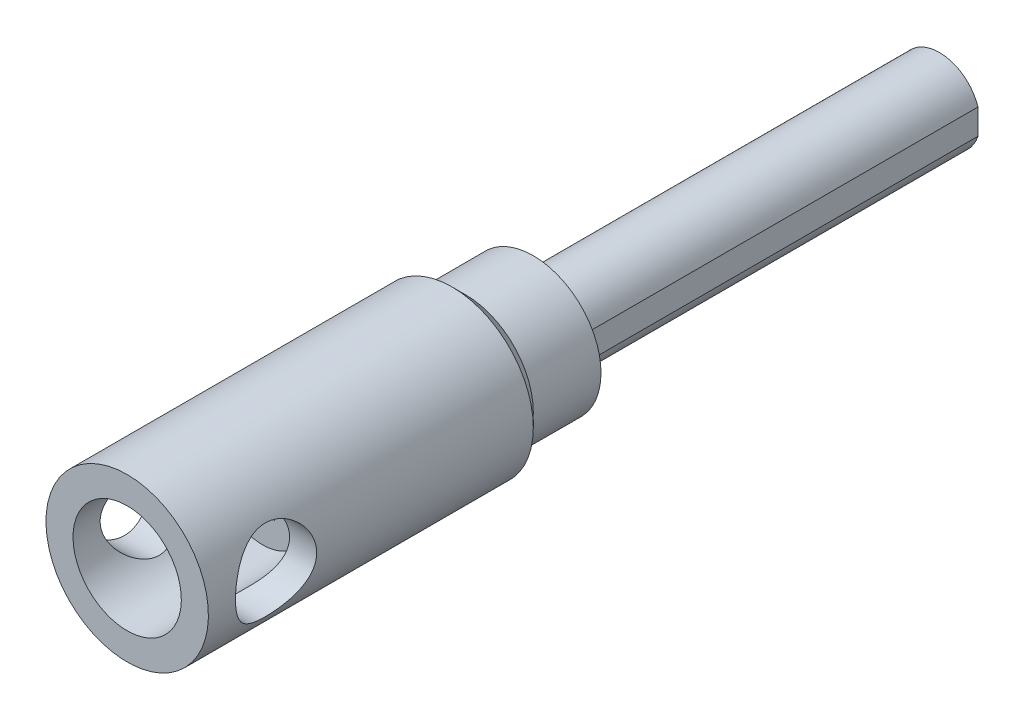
ISO-10303-21;
HEADER;
FILE_DESCRIPTION(('STEP AP214'),'2;1');
FILE_NAME('part.step','',(''),(''),'','','');
FILE_SCHEMA(('AUTOMOTIVE_DESIGN { 1 0 10303 214 1 1 1 1 }'));
ENDSEC;
DATA;
#1=APPLICATION_CONTEXT('core data for automotive mechanical design processes');
#2=APPLICATION_PROTOCOL_DEFINITION('international standard','automotive_design',2000,#1);
#3=PRODUCT_CONTEXT('',#1,'mechanical');
#4=PRODUCT('Part','Part','',(#3));
#5=PRODUCT_RELATED_PRODUCT_CATEGORY('part','',(#4));
#6=PRODUCT_DEFINITION_FORMATION('','',#4);
#7=PRODUCT_DEFINITION_CONTEXT('part definition',#1,'design');
#8=PRODUCT_DEFINITION('design','',#6,#7);
#9=PRODUCT_DEFINITION_SHAPE('','',#8);
#10=(LENGTH_UNIT() NAMED_UNIT(*) SI_UNIT(.MILLI.,.METRE.));
#11=(NAMED_UNIT(*) PLANE_ANGLE_UNIT() SI_UNIT($,.RADIAN.));
#12=(NAMED_UNIT(*) SI_UNIT($,.STERADIAN.) SOLID_ANGLE_UNIT());
#13=UNCERTAINTY_MEASURE_WITH_UNIT(LENGTH_MEASURE(1.E-05),#10,'distance_accuracy_value','');
#14=(GEOMETRIC_REPRESENTATION_CONTEXT(3) GLOBAL_UNCERTAINTY_ASSIGNED_CONTEXT((#13)) GLOBAL_UNIT_ASSIGNED_CONTEXT((#10,
#11,#12)) REPRESENTATION_CONTEXT('',''));
#15=CARTESIAN_POINT('',(0.,0.,0.));
#16=DIRECTION('',(0.,0.,1.));
#17=DIRECTION('',(1.,0.,0.));
#18=AXIS2_PLACEMENT_3D('',#15,#16,#17);
#19=CARTESIAN_POINT('',(-1.73205080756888,8.40265377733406E-13,48.));
#20=DIRECTION('',(0.866025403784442,-0.5,0.));
#21=DIRECTION('',(0.5,0.866025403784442,0.));
#22=AXIS2_PLACEMENT_3D('',#19,#20,#21);
#23=PLANE('',#22);
#24=DIRECTION('',(0.,0.,1.));
#25=VECTOR('',#24,1.);
#26=CARTESIAN_POINT('',(-0.866025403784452,1.50000000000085,48.));
#27=LINE('',#26,#25);
#28=CARTESIAN_POINT('',(-0.866025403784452,1.50000000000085,48.));
#29=VERTEX_POINT('',#28);
#30=CARTESIAN_POINT('',(-0.866025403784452,1.50000000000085,50.));
#31=VERTEX_POINT('',#30);
#32=EDGE_CURVE('E257',#29,#31,#27,.T.);
#33=ORIENTED_EDGE('',*,*,#32,.T.);
#34=DIRECTION('',(0.5,0.866025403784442,0.));
#35=VECTOR('',#34,1.);
#36=CARTESIAN_POINT('',(-1.73205080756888,8.40496674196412E-13,50.));
#37=LINE('',#36,#35);
#38=CARTESIAN_POINT('',(-1.73205080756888,8.40605094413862E-13,50.));
#39=VERTEX_POINT('',#38);
#40=EDGE_CURVE('E29',#39,#31,#37,.T.);
#41=ORIENTED_EDGE('',*,*,#40,.F.);
#42=DIRECTION('',(0.,0.,1.));
#43=VECTOR('',#42,1.);
#44=CARTESIAN_POINT('',(-1.73205080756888,8.40265377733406E-13,48.));
#45=LINE('',#44,#43);
#46=CARTESIAN_POINT('',(-1.73205080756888,8.40265377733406E-13,48.));
#47=VERTEX_POINT('',#46);
#48=EDGE_CURVE('E33',#47,#39,#45,.T.);
#49=ORIENTED_EDGE('',*,*,#48,.F.);
#50=DIRECTION('',(0.5,0.866025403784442,0.));
#51=VECTOR('',#50,1.);
#52=CARTESIAN_POINT('',(-1.73205080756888,8.40265377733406E-13,48.));
#53=LINE('',#52,#51);
#54=EDGE_CURVE('E218',#47,#29,#53,.T.);
#55=ORIENTED_EDGE('',*,*,#54,.T.);
#56=EDGE_LOOP('',(#33,#41,#49,#55));
#57=FACE_BOUND('',#56,.T.);
#58=ADVANCED_FACE('F14',(#57),#23,.T.);
#59=CARTESIAN_POINT('',(0.86602540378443,1.50000000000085,48.));
#60=DIRECTION('',(0.,1.,0.));
#61=DIRECTION('',(-1.,0.,0.));
#62=AXIS2_PLACEMENT_3D('',#59,#60,#61);
#63=PLANE('',#62);
#64=DIRECTION('',(0.,0.,1.));
#65=VECTOR('',#64,1.);
#66=CARTESIAN_POINT('',(0.86602540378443,1.50000000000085,48.));
#67=LINE('',#66,#65);
#68=CARTESIAN_POINT('',(0.86602540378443,1.50000000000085,48.));
#69=VERTEX_POINT('',#68);
#70=CARTESIAN_POINT('',(0.86602540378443,1.50000000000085,50.));
#71=VERTEX_POINT('',#70);
#72=EDGE_CURVE('E255',#69,#71,#67,.T.);
#73=ORIENTED_EDGE('',*,*,#72,.T.);
#74=DIRECTION('',(-1.,0.,0.));
#75=VECTOR('',#74,1.);
#76=CARTESIAN_POINT('',(0.86602540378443,1.50000000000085,50.));
#77=LINE('',#76,#75);
#78=EDGE_CURVE('E230',#71,#31,#77,.T.);
#79=ORIENTED_EDGE('',*,*,#78,.T.);
#80=ORIENTED_EDGE('',*,*,#32,.F.);
#81=DIRECTION('',(-1.,0.,0.));
#82=VECTOR('',#81,1.);
#83=CARTESIAN_POINT('',(0.86602540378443,1.50000000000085,48.));
#84=LINE('',#83,#82);
#85=EDGE_CURVE('E220',#69,#29,#84,.T.);
#86=ORIENTED_EDGE('',*,*,#85,.F.);
#87=EDGE_LOOP('',(#73,#79,#80,#86));
#88=FACE_BOUND('',#87,.T.);
#89=ADVANCED_FACE('F172',(#88),#63,.F.);
#90=CARTESIAN_POINT('',(1.73205080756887,8.54675106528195E-13,48.));
#91=DIRECTION('',(0.866025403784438,0.5,0.));
#92=DIRECTION('',(-0.5,0.866025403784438,0.));
#93=AXIS2_PLACEMENT_3D('',#90,#91,#92);
#94=PLANE('',#93);
#95=DIRECTION('',(0.,0.,1.));
#96=VECTOR('',#95,1.);
#97=CARTESIAN_POINT('',(1.73205080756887,8.54675106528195E-13,48.));
#98=LINE('',#97,#96);
#99=CARTESIAN_POINT('',(1.73205080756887,8.54675106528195E-13,48.));
#100=VERTEX_POINT('',#99);
#101=CARTESIAN_POINT('',(1.73205080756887,8.54906402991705E-13,50.));
#102=VERTEX_POINT('',#101);
#103=EDGE_CURVE('E253',#100,#102,#98,.T.);
#104=ORIENTED_EDGE('',*,*,#103,.T.);
#105=DIRECTION('',(-0.5,0.866025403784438,0.));
#106=VECTOR('',#105,1.);
#107=CARTESIAN_POINT('',(1.73205080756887,8.54906402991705E-13,50.));
#108=LINE('',#107,#106);
#109=EDGE_CURVE('E227',#102,#71,#108,.T.);
#110=ORIENTED_EDGE('',*,*,#109,.T.);
#111=ORIENTED_EDGE('',*,*,#72,.F.);
#112=DIRECTION('',(-0.5,0.866025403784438,0.));
#113=VECTOR('',#112,1.);
#114=CARTESIAN_POINT('',(1.73205080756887,8.54675106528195E-13,48.));
#115=LINE('',#114,#113);
#116=EDGE_CURVE('E243',#100,#69,#115,.T.);
#117=ORIENTED_EDGE('',*,*,#116,.F.);
#118=EDGE_LOOP('',(#104,#110,#111,#117));
#119=FACE_BOUND('',#118,.T.);
#120=ADVANCED_FACE('F177',(#119),#94,.F.);
#121=CARTESIAN_POINT('',(1.73205080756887,8.54675106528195E-13,48.));
#122=DIRECTION('',(-0.866025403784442,0.5,0.));
#123=DIRECTION('',(-0.5,-0.866025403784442,0.));
#124=AXIS2_PLACEMENT_3D('',#121,#122,#123);
#125=PLANE('',#124);
#126=DIRECTION('',(0.,0.,1.));
#127=VECTOR('',#126,1.);
#128=CARTESIAN_POINT('',(0.866025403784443,-1.49999999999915,48.));
#129=LINE('',#128,#127);
#130=CARTESIAN_POINT('',(0.866025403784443,-1.49999999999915,48.));
#131=VERTEX_POINT('',#130);
#132=CARTESIAN_POINT('',(0.866025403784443,-1.49999999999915,50.));
#133=VERTEX_POINT('',#132);
#134=EDGE_CURVE('E251',#131,#133,#129,.T.);
#135=ORIENTED_EDGE('',*,*,#134,.T.);
#136=DIRECTION('',(-0.5,-0.866025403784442,0.));
#137=VECTOR('',#136,1.);
#138=CARTESIAN_POINT('',(1.73205080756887,8.54906402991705E-13,50.));
#139=LINE('',#138,#137);
#140=EDGE_CURVE('E222',#102,#133,#139,.T.);
#141=ORIENTED_EDGE('',*,*,#140,.F.);
#142=ORIENTED_EDGE('',*,*,#103,.F.);
#143=DIRECTION('',(-0.5,-0.866025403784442,0.));
#144=VECTOR('',#143,1.);
#145=CARTESIAN_POINT('',(1.73205080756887,8.54675106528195E-13,48.));
#146=LINE('',#145,#144);
#147=EDGE_CURVE('E240',#100,#131,#146,.T.);
#148=ORIENTED_EDGE('',*,*,#147,.T.);
#149=EDGE_LOOP('',(#135,#141,#142,#148));
#150=FACE_BOUND('',#149,.T.);
#151=ADVANCED_FACE('F189',(#150),#125,.T.);
#152=CARTESIAN_POINT('',(-0.866025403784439,-1.49999999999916,48.));
#153=DIRECTION('',(0.,-1.,0.));
#154=DIRECTION('',(1.,0.,0.));
#155=AXIS2_PLACEMENT_3D('',#152,#153,#154);
#156=PLANE('',#155);
#157=DIRECTION('',(0.,0.,1.));
#158=VECTOR('',#157,1.);
#159=CARTESIAN_POINT('',(-0.866025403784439,-1.49999999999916,48.));
#160=LINE('',#159,#158);
#161=CARTESIAN_POINT('',(-0.866025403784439,-1.49999999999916,48.));
#162=VERTEX_POINT('',#161);
#163=CARTESIAN_POINT('',(-0.866025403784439,-1.49999999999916,50.));
#164=VERTEX_POINT('',#163);
#165=EDGE_CURVE('E249',#162,#164,#160,.T.);
#166=ORIENTED_EDGE('',*,*,#165,.T.);
#167=DIRECTION('',(1.,0.,0.));
#168=VECTOR('',#167,1.);
#169=CARTESIAN_POINT('',(-0.866025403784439,-1.49999999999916,50.));
#170=LINE('',#169,#168);
#171=EDGE_CURVE('E217',#164,#133,#170,.T.);
#172=ORIENTED_EDGE('',*,*,#171,.T.);
#173=ORIENTED_EDGE('',*,*,#134,.F.);
#174=DIRECTION('',(1.,0.,0.));
#175=VECTOR('',#174,1.);
#176=CARTESIAN_POINT('',(-0.866025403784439,-1.49999999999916,48.));
#177=LINE('',#176,#175);
#178=EDGE_CURVE('E237',#162,#131,#177,.T.);
#179=ORIENTED_EDGE('',*,*,#178,.F.);
#180=EDGE_LOOP('',(#166,#172,#173,#179));
#181=FACE_BOUND('',#180,.T.);
#182=ADVANCED_FACE('F185',(#181),#156,.F.);
#183=CARTESIAN_POINT('',(-1.73205080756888,8.40265377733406E-13,48.));
#184=DIRECTION('',(-0.866025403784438,-0.5,0.));
#185=DIRECTION('',(0.5,-0.866025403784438,0.));
#186=AXIS2_PLACEMENT_3D('',#183,#184,#185);
#187=PLANE('',#186);
#188=DIRECTION('',(0.5,-0.866025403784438,0.));
#189=VECTOR('',#188,1.);
#190=CARTESIAN_POINT('',(-1.73205080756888,8.40265377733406E-13,48.));
#191=LINE('',#190,#189);
#192=EDGE_CURVE('E234',#47,#162,#191,.T.);
#193=ORIENTED_EDGE('',*,*,#192,.F.);
#194=ORIENTED_EDGE('',*,*,#48,.T.);
#195=DIRECTION('',(0.5,-0.866025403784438,0.));
#196=VECTOR('',#195,1.);
#197=CARTESIAN_POINT('',(-1.73205080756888,8.40496674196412E-13,50.));
#198=LINE('',#197,#196);
#199=EDGE_CURVE('E213',#39,#164,#198,.T.);
#200=ORIENTED_EDGE('',*,*,#199,.T.);
#201=ORIENTED_EDGE('',*,*,#165,.F.);
#202=EDGE_LOOP('',(#193,#194,#200,#201));
#203=FACE_BOUND('',#202,.T.);
#204=ADVANCED_FACE('F182',(#203),#187,.F.);
#205=CARTESIAN_POINT('',(-0.866025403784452,1.50000000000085,48.));
#206=DIRECTION('',(0.,0.,1.));
#207=DIRECTION('',(0.,1.,0.));
#208=AXIS2_PLACEMENT_3D('',#205,#206,#207);
#209=PLANE('',#208);
#210=ORIENTED_EDGE('',*,*,#54,.F.);
#211=ORIENTED_EDGE('',*,*,#192,.T.);
#212=ORIENTED_EDGE('',*,*,#178,.T.);
#213=ORIENTED_EDGE('',*,*,#147,.F.);
#214=ORIENTED_EDGE('',*,*,#116,.T.);
#215=ORIENTED_EDGE('',*,*,#85,.T.);
#216=EDGE_LOOP('',(#210,#211,#212,#213,#214,#215));
#217=FACE_BOUND('',#216,.T.);
#218=ADVANCED_FACE('F181',(#217),#209,.T.);
#219=CARTESIAN_POINT('',(0.,8.47701538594E-13,50.));
#220=DIRECTION('',(0.,0.,1.));
#221=DIRECTION('',(0.,1.,0.));
#222=AXIS2_PLACEMENT_3D('',#219,#220,#221);
#223=PLANE('',#222);
#224=CARTESIAN_POINT('',(0.,8.47701538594E-13,50.));
#225=DIRECTION('',(0.,0.,1.));
#226=DIRECTION('',(0.,1.,0.));
#227=AXIS2_PLACEMENT_3D('',#224,#225,#226);
#228=CIRCLE('',#227,3.5);
#229=CARTESIAN_POINT('',(0.,3.50000000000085,50.));
#230=VERTEX_POINT('',#229);
#231=EDGE_CURVE('E9',#230,#230,#228,.T.);
#232=ORIENTED_EDGE('',*,*,#231,.T.);
#233=EDGE_LOOP('',(#232));
#234=FACE_BOUND('',#233,.T.);
#235=ORIENTED_EDGE('',*,*,#199,.F.);
#236=ORIENTED_EDGE('',*,*,#40,.T.);
#237=ORIENTED_EDGE('',*,*,#78,.F.);
#238=ORIENTED_EDGE('',*,*,#109,.F.);
#239=ORIENTED_EDGE('',*,*,#140,.T.);
#240=ORIENTED_EDGE('',*,*,#171,.F.);
#241=EDGE_LOOP('',(#235,#236,#237,#238,#239,#240));
#242=FACE_BOUND('',#241,.T.);
#243=ADVANCED_FACE('F16',(#234,#242),#223,.T.);
#244=CARTESIAN_POINT('',(0.,8.48164131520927E-13,54.));
#245=DIRECTION('',(0.,0.,1.));
#246=DIRECTION('',(0.,1.,0.));
#247=AXIS2_PLACEMENT_3D('',#244,#245,#246);
#248=CYLINDRICAL_SURFACE('',#247,3.5);
#249=CARTESIAN_POINT('',(0.,8.47238945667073E-13,46.));
#250=DIRECTION('',(0.,0.,1.));
#251=DIRECTION('',(0.,1.,0.));
#252=AXIS2_PLACEMENT_3D('',#249,#250,#251);
#253=CIRCLE('',#252,3.5);
#254=CARTESIAN_POINT('',(0.,3.50000000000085,46.));
#255=VERTEX_POINT('',#254);
#256=EDGE_CURVE('E22',#255,#255,#253,.T.);
#257=ORIENTED_EDGE('',*,*,#256,.T.);
#258=EDGE_LOOP('',(#257));
#259=FACE_BOUND('',#258,.T.);
#260=ORIENTED_EDGE('',*,*,#231,.F.);
#261=EDGE_LOOP('',(#260));
#262=FACE_BOUND('',#261,.T.);
#263=ADVANCED_FACE('F196',(#259,#262),#248,.T.);
#264=CARTESIAN_POINT('',(3.,0.,0.));
#265=DIRECTION('',(0.,0.,-1.));
#266=DIRECTION('',(1.,0.,0.));
#267=AXIS2_PLACEMENT_3D('',#264,#265,#266);
#268=PLANE('',#267);
#269=DIRECTION('',(0.,-1.,0.));
#270=VECTOR('',#269,1.);
#271=CARTESIAN_POINT('',(2.85,-0.93674969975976,0.));
#272=LINE('',#271,#270);
#273=CARTESIAN_POINT('',(2.85,0.936749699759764,0.));
#274=VERTEX_POINT('',#273);
#275=CARTESIAN_POINT('',(2.85,-0.936749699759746,0.));
#276=VERTEX_POINT('',#275);
#277=EDGE_CURVE('E78',#274,#276,#272,.T.);
#278=ORIENTED_EDGE('',*,*,#277,.T.);
#279=CARTESIAN_POINT('',(0.,0.,0.));
#280=DIRECTION('',(0.,0.,-1.));
#281=DIRECTION('',(1.,0.,0.));
#282=AXIS2_PLACEMENT_3D('',#279,#280,#281);
#283=CIRCLE('',#282,3.);
#284=EDGE_CURVE('E91',#276,#274,#283,.T.);
#285=ORIENTED_EDGE('',*,*,#284,.T.);
#286=EDGE_LOOP('',(#278,#285));
#287=FACE_BOUND('',#286,.T.);
#288=ADVANCED_FACE('F95',(#287),#268,.T.);
#289=CARTESIAN_POINT('',(0.,0.,0.));
#290=DIRECTION('',(0.,0.,-1.));
#291=DIRECTION('',(1.,0.,0.));
#292=AXIS2_PLACEMENT_3D('',#289,#290,#291);
#293=CYLINDRICAL_SURFACE('',#292,3.);
#294=CARTESIAN_POINT('',(0.,0.,30.));
#295=DIRECTION('',(0.,0.,1.));
#296=DIRECTION('',(1.,-2.05102760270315E-10,0.));
#297=AXIS2_PLACEMENT_3D('',#294,#295,#296);
#298=CIRCLE('',#297,3.);
#299=CARTESIAN_POINT('',(2.85,0.936749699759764,30.));
#300=VERTEX_POINT('',#299);
#301=CARTESIAN_POINT('',(2.85,-0.93674969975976,30.));
#302=VERTEX_POINT('',#301);
#303=EDGE_CURVE('E93',#300,#302,#298,.T.);
#304=ORIENTED_EDGE('',*,*,#303,.F.);
#305=DIRECTION('',(0.,0.,1.));
#306=VECTOR('',#305,1.);
#307=CARTESIAN_POINT('',(2.85,0.936749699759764,0.));
#308=LINE('',#307,#306);
#309=EDGE_CURVE('E81',#274,#300,#308,.T.);
#310=ORIENTED_EDGE('',*,*,#309,.F.);
#311=ORIENTED_EDGE('',*,*,#284,.F.);
#312=DIRECTION('',(0.,0.,1.));
#313=VECTOR('',#312,1.);
#314=CARTESIAN_POINT('',(2.85,-0.93674969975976,0.));
#315=LINE('',#314,#313);
#316=EDGE_CURVE('E83',#276,#302,#315,.T.);
#317=ORIENTED_EDGE('',*,*,#316,.T.);
#318=EDGE_LOOP('',(#304,#310,#311,#317));
#319=FACE_BOUND('',#318,.T.);
#320=ADVANCED_FACE('F90',(#319),#293,.T.);
#321=CARTESIAN_POINT('',(2.85,-0.93674969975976,0.));
#322=DIRECTION('',(-1.,0.,0.));
#323=DIRECTION('',(0.,-1.,0.));
#324=AXIS2_PLACEMENT_3D('',#321,#322,#323);
#325=PLANE('',#324);
#326=ORIENTED_EDGE('',*,*,#309,.T.);
#327=DIRECTION('',(0.,-1.,0.));
#328=VECTOR('',#327,1.);
#329=CARTESIAN_POINT('',(2.85,5.0000000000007,30.));
#330=LINE('',#329,#328);
#331=EDGE_CURVE('E389',#300,#302,#330,.T.);
#332=ORIENTED_EDGE('',*,*,#331,.T.);
#333=ORIENTED_EDGE('',*,*,#316,.F.);
#334=ORIENTED_EDGE('',*,*,#277,.F.);
#335=EDGE_LOOP('',(#326,#332,#333,#334));
#336=FACE_BOUND('',#335,.T.);
#337=ADVANCED_FACE('F80',(#336),#325,.F.);
#338=CARTESIAN_POINT('',(0.,5.00000000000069,30.));
#339=DIRECTION('',(0.,0.,1.));
#340=DIRECTION('',(0.,-1.,0.));
#341=AXIS2_PLACEMENT_3D('',#338,#339,#340);
#342=PLANE('',#341);
#343=ORIENTED_EDGE('',*,*,#331,.F.);
#344=ORIENTED_EDGE('',*,*,#303,.T.);
#345=EDGE_LOOP('',(#343,#344));
#346=FACE_BOUND('',#345,.T.);
#347=CARTESIAN_POINT('',(0.,8.45388573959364E-13,30.));
#348=DIRECTION('',(0.,0.,-1.));
#349=DIRECTION('',(0.,1.,0.));
#350=AXIS2_PLACEMENT_3D('',#347,#348,#349);
#351=CIRCLE('',#350,4.99999999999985);
#352=CARTESIAN_POINT('',(0.,5.0000000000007,30.));
#353=VERTEX_POINT('',#352);
#354=EDGE_CURVE('E383',#353,#353,#351,.T.);
#355=ORIENTED_EDGE('',*,*,#354,.T.);
#356=EDGE_LOOP('',(#355));
#357=FACE_BOUND('',#356,.T.);
#358=ADVANCED_FACE('F156',(#346,#357),#342,.F.);
#359=CARTESIAN_POINT('',(0.,8.42416414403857E-13,4.3));
#360=DIRECTION('',(0.,0.,-1.));
#361=DIRECTION('',(0.,1.,0.));
#362=AXIS2_PLACEMENT_3D('',#359,#360,#361);
#363=CYLINDRICAL_SURFACE('',#362,4.99999999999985);
#364=ORIENTED_EDGE('',*,*,#354,.F.);
#365=EDGE_LOOP('',(#364));
#366=FACE_BOUND('',#365,.T.);
#367=CARTESIAN_POINT('',(0.,8.45966815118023E-13,35.));
#368=DIRECTION('',(0.,0.,-1.));
#369=DIRECTION('',(0.,1.,0.));
#370=AXIS2_PLACEMENT_3D('',#367,#368,#369);
#371=CIRCLE('',#370,4.99999999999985);
#372=CARTESIAN_POINT('',(0.,5.0000000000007,35.));
#373=VERTEX_POINT('',#372);
#374=EDGE_CURVE('E385',#373,#373,#371,.T.);
#375=ORIENTED_EDGE('',*,*,#374,.T.);
#376=EDGE_LOOP('',(#375));
#377=FACE_BOUND('',#376,.T.);
#378=ADVANCED_FACE('F158',(#366,#377),#363,.T.);
#379=CARTESIAN_POINT('',(0.,8.45966815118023E-13,35.));
#380=DIRECTION('',(0.,0.,1.));
#381=DIRECTION('',(0.,-1.,0.));
#382=AXIS2_PLACEMENT_3D('',#379,#380,#381);
#383=CONICAL_SURFACE('',#382,5.,0.785398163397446);
#384=CARTESIAN_POINT('',(0.,8.46082463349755E-13,36.));
#385=DIRECTION('',(0.,0.,1.));
#386=DIRECTION('',(0.,-1.,0.));
#387=AXIS2_PLACEMENT_3D('',#384,#385,#386);
#388=CIRCLE('',#387,6.);
#389=CARTESIAN_POINT('',(0.,-5.99999999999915,36.));
#390=VERTEX_POINT('',#389);
#391=EDGE_CURVE('E145',#390,#390,#388,.T.);
#392=ORIENTED_EDGE('',*,*,#391,.F.);
#393=EDGE_LOOP('',(#392));
#394=FACE_BOUND('',#393,.T.);
#395=ORIENTED_EDGE('',*,*,#374,.F.);
#396=EDGE_LOOP('',(#395));
#397=FACE_BOUND('',#396,.T.);
#398=ADVANCED_FACE('F128',(#394,#397),#383,.T.);
#399=CARTESIAN_POINT('',(0.,8.42416414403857E-13,4.3));
#400=DIRECTION('',(0.,0.,-1.));
#401=DIRECTION('',(0.,1.,0.));
#402=AXIS2_PLACEMENT_3D('',#399,#400,#401);
#403=CYLINDRICAL_SURFACE('',#402,6.);
#404=ORIENTED_EDGE('',*,*,#391,.T.);
#405=EDGE_LOOP('',(#404));
#406=FACE_BOUND('',#405,.T.);
#407=CARTESIAN_POINT('',(-6.,8.23668342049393E-13,58.));
#408=CARTESIAN_POINT('',(-5.99999934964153,-0.0788941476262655,57.9999991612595));
#409=CARTESIAN_POINT('',(-5.99843869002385,-0.157796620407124,57.9968820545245));
#410=CARTESIAN_POINT('',(-5.99224358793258,-0.315001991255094,57.98446072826));
#411=CARTESIAN_POINT('',(-5.98760776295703,-0.393304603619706,57.9751537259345));
#412=CARTESIAN_POINT('',(-5.96921978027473,-0.626628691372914,57.9380421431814));
#413=CARTESIAN_POINT('',(-5.95098734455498,-0.779952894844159,57.9010471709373));
#414=CARTESIAN_POINT('',(-5.90448966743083,-1.07683586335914,57.8044182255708));
#415=CARTESIAN_POINT('',(-5.87626344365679,-1.22043005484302,57.7448722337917));
#416=CARTESIAN_POINT('',(-5.81237302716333,-1.49540820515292,57.6052887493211));
#417=CARTESIAN_POINT('',(-5.77670942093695,-1.62679312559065,57.5252528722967));
#418=CARTESIAN_POINT('',(-5.69868752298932,-1.88252701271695,57.3414460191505));
#419=CARTESIAN_POINT('',(-5.65605474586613,-2.00596945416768,57.2365320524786));
#420=CARTESIAN_POINT('',(-5.5698003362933,-2.23433451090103,57.0084440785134));
#421=CARTESIAN_POINT('',(-5.5261779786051,-2.33924301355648,56.8852562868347));
#422=CARTESIAN_POINT('',(-5.43896347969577,-2.53576864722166,56.6125156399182));
#423=CARTESIAN_POINT('',(-5.39563602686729,-2.62572411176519,56.4616590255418));
#424=CARTESIAN_POINT('',(-5.33782449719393,-2.74034031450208,56.2240491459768));
#425=CARTESIAN_POINT('',(-5.31974570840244,-2.77516786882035,56.1429290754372));
#426=CARTESIAN_POINT('',(-5.28665768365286,-2.83769299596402,55.9773994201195));
#427=CARTESIAN_POINT('',(-5.27164663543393,-2.86539478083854,55.8929918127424));
#428=CARTESIAN_POINT('',(-5.24610341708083,-2.91188280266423,55.7266042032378));
#429=CARTESIAN_POINT('',(-5.23535838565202,-2.93110042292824,55.6447772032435));
#430=CARTESIAN_POINT('',(-5.21757784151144,-2.96263559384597,55.4794450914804));
#431=CARTESIAN_POINT('',(-5.21054036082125,-2.97495680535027,55.3959408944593));
#432=CARTESIAN_POINT('',(-5.20047756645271,-2.99251382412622,55.2279936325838));
#433=CARTESIAN_POINT('',(-5.19744983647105,-2.99775389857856,55.1435511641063));
#434=CARTESIAN_POINT('',(-5.19552555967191,-3.00108452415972,54.9745063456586));
#435=CARTESIAN_POINT('',(-5.19662861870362,-2.99917575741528,54.8899040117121));
#436=CARTESIAN_POINT('',(-5.20534668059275,-2.98404973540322,54.6572461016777));
#437=CARTESIAN_POINT('',(-5.21726794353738,-2.96335042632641,54.5097558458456));
#438=CARTESIAN_POINT('',(-5.25228182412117,-2.90082280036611,54.220806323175));
#439=CARTESIAN_POINT('',(-5.2753780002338,-2.85898775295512,54.0793489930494));
#440=CARTESIAN_POINT('',(-5.33062568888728,-2.75462843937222,53.8023203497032));
#441=CARTESIAN_POINT('',(-5.36297559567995,-2.69164495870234,53.6669628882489));
#442=CARTESIAN_POINT('',(-5.43310175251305,-2.54712530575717,53.408095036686));
#443=CARTESIAN_POINT('',(-5.4708804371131,-2.46558080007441,53.2845900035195));
#444=CARTESIAN_POINT('',(-5.55339485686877,-2.27419808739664,53.0364369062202));
#445=CARTESIAN_POINT('',(-5.59840533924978,-2.16208335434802,52.9136295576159));
#446=CARTESIAN_POINT('',(-5.68642866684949,-1.91866675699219,52.687793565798));
#447=CARTESIAN_POINT('',(-5.72944054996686,-1.78735577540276,52.5847743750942));
#448=CARTESIAN_POINT('',(-5.81105962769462,-1.50154951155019,52.3969430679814));
#449=CARTESIAN_POINT('',(-5.84936952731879,-1.34626077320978,52.3131985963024));
#450=CARTESIAN_POINT('',(-5.91473643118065,-1.02139864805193,52.1737088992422));
#451=CARTESIAN_POINT('',(-5.94180236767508,-0.851836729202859,52.1179414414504));
#452=CARTESIAN_POINT('',(-5.97973001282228,-0.51829947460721,52.0405737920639));
#453=CARTESIAN_POINT('',(-5.99174814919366,-0.355024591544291,52.0165262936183));
#454=CARTESIAN_POINT('',(-6.00219040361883,-0.0263387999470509,51.9956058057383));
#455=CARTESIAN_POINT('',(-6.00062096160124,0.13907105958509,51.9987199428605));
#456=CARTESIAN_POINT('',(-5.98473576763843,0.45369891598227,52.0306200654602));
#457=CARTESIAN_POINT('',(-5.97141737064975,0.60317822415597,52.0573975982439));
#458=CARTESIAN_POINT('',(-5.93466513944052,0.895220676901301,52.1327142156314));
#459=CARTESIAN_POINT('',(-5.91123019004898,1.03778305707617,52.1812556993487));
#460=CARTESIAN_POINT('',(-5.85552754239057,1.3166658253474,52.2999953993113));
#461=CARTESIAN_POINT('',(-5.82302645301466,1.45269119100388,52.3707731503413));
#462=CARTESIAN_POINT('',(-5.75231922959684,1.71138408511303,52.5313226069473));
#463=CARTESIAN_POINT('',(-5.71411066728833,1.83404588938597,52.6211024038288));
#464=CARTESIAN_POINT('',(-5.63124663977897,2.07530306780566,52.8272812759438));
#465=CARTESIAN_POINT('',(-5.58632654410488,2.19231623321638,52.9454286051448));
#466=CARTESIAN_POINT('',(-5.49787174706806,2.40556896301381,53.1997754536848));
#467=CARTESIAN_POINT('',(-5.45433802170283,2.50179415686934,53.3359873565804));
#468=CARTESIAN_POINT('',(-5.37153576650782,2.67512374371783,53.6309309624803));
#469=CARTESIAN_POINT('',(-5.33257588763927,2.75107648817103,53.7904337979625));
#470=CARTESIAN_POINT('',(-5.26722216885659,2.87424847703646,54.1225302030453));
#471=CARTESIAN_POINT('',(-5.24081214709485,2.9215047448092,54.2951065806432));
#472=CARTESIAN_POINT('',(-5.20684503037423,2.98158506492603,54.6307306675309));
#473=CARTESIAN_POINT('',(-5.19772150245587,2.99727899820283,54.7931027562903));
#474=CARTESIAN_POINT('',(-5.19496064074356,3.00206745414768,55.1183412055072));
#475=CARTESIAN_POINT('',(-5.2013165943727,2.99117350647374,55.2812073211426));
#476=CARTESIAN_POINT('',(-5.22713585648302,2.94577840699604,55.5864504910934));
#477=CARTESIAN_POINT('',(-5.24529281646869,2.9136250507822,55.7293013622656));
#478=CARTESIAN_POINT('',(-5.29113050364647,2.82952596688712,56.0074244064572));
#479=CARTESIAN_POINT('',(-5.31881429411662,2.77757387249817,56.1426941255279));
#480=CARTESIAN_POINT('',(-5.38285583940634,2.65144766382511,56.4118743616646));
#481=CARTESIAN_POINT('',(-5.41967139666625,2.57601505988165,56.5450829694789));
#482=CARTESIAN_POINT('',(-5.49706022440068,2.40645126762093,56.7978243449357));
#483=CARTESIAN_POINT('',(-5.53763544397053,2.31231035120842,56.9173499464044));
#484=CARTESIAN_POINT('',(-5.6238685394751,2.09461689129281,57.154422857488));
#485=CARTESIAN_POINT('',(-5.66954494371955,1.9688805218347,57.2699651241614));
#486=CARTESIAN_POINT('',(-5.75633712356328,1.69843715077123,57.478801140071));
#487=CARTESIAN_POINT('',(-5.79745043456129,1.55371998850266,57.5720828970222));
#488=CARTESIAN_POINT('',(-5.85251406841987,1.32452333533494,57.6931781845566));
#489=CARTESIAN_POINT('',(-5.86982524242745,1.24575314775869,57.7305202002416));
#490=CARTESIAN_POINT('',(-5.90168845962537,1.08479725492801,57.7983616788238));
#491=CARTESIAN_POINT('',(-5.91624185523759,1.00261324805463,57.8288644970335));
#492=CARTESIAN_POINT('',(-5.94212690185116,0.835616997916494,57.8826072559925));
#493=CARTESIAN_POINT('',(-5.9534655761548,0.750810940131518,57.905863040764));
#494=CARTESIAN_POINT('',(-5.9726077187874,0.579142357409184,57.9448825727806));
#495=CARTESIAN_POINT('',(-5.98041334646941,0.492281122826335,57.9606508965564));
#496=CARTESIAN_POINT('',(-5.99085829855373,0.337824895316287,57.9816846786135));
#497=CARTESIAN_POINT('',(-5.99428035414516,0.270495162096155,57.988546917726));
#498=CARTESIAN_POINT('',(-5.99885151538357,0.135445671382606,57.9977050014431));
#499=CARTESIAN_POINT('',(-6.00000055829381,0.0677259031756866,58.0000007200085));
#500=CARTESIAN_POINT('',(-6.,8.23668342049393E-13,58.));
#501=B_SPLINE_CURVE_WITH_KNOTS('',3,(#407,#408,#409,#410,#411,#412,#413,#414,#415,#416,#417,
#418,#419,#420,#421,#422,#423,#424,#425,#426,#427,#428,#429,#430,#431,#432,#433,#434,#435,#436,
#437,#438,#439,#440,#441,#442,#443,#444,#445,#446,#447,#448,#449,#450,#451,#452,#453,#454,#455,
#456,#457,#458,#459,#460,#461,#462,#463,#464,#465,#466,#467,#468,#469,#470,#471,#472,#473,#474,
#475,#476,#477,#478,#479,#480,#481,#482,#483,#484,#485,#486,#487,#488,#489,#490,#491,#492,#493,
#494,#495,#496,#497,#498,#499,#500),.UNSPECIFIED.,.T.,.F.,(4,2,2,2,2,2,2,2,2,2,2,2,2,2,2,2,2,2,
2,2,2,2,2,2,2,2,2,2,2,2,2,2,2,2,2,2,2,2,2,2,2,2,2,2,2,2,4),(0.,0.236611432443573,
0.473329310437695,0.947100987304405,1.41904300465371,1.89094781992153,2.3914018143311,
2.89223525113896,3.43190833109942,3.70192714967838,3.97178599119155,4.2256372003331,
4.47935352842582,4.73291689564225,4.9864560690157,5.4323867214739,5.87845946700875,
6.33492255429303,6.79159098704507,7.30616358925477,7.82098138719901,8.35970601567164,
8.89800185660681,9.39171406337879,9.8851922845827,10.3404225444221,10.7957029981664,
11.2640010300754,11.7324988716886,12.2470036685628,12.7618630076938,13.3016558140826,
13.8407507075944,14.3280945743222,14.8152271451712,15.2559532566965,15.6968212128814,
16.1673090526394,16.6380421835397,17.1659726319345,17.6941868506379,17.9605054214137,
18.2266930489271,18.4922945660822,18.7577335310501,18.9608446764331,19.1639614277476),.UNSPECIFIED.);
#502=CARTESIAN_POINT('',(-6.,8.23668342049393E-13,58.));
#503=VERTEX_POINT('',#502);
#504=EDGE_CURVE('E111',#503,#503,#501,.T.);
#505=ORIENTED_EDGE('',*,*,#504,.T.);
#506=EDGE_LOOP('',(#505));
#507=FACE_BOUND('',#506,.T.);
#508=CARTESIAN_POINT('',(6.,8.7358510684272E-13,58.));
#509=CARTESIAN_POINT('',(5.99999934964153,0.0788941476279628,57.9999991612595));
#510=CARTESIAN_POINT('',(5.99843869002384,0.157796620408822,57.9968820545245));
#511=CARTESIAN_POINT('',(5.99224358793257,0.315001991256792,57.98446072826));
#512=CARTESIAN_POINT('',(5.98760776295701,0.393304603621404,57.9751537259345));
#513=CARTESIAN_POINT('',(5.96921978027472,0.626628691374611,57.9380421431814));
#514=CARTESIAN_POINT('',(5.95098734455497,0.779952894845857,57.9010471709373));
#515=CARTESIAN_POINT('',(5.90448966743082,1.07683586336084,57.8044182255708));
#516=CARTESIAN_POINT('',(5.87626344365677,1.22043005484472,57.7448722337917));
#517=CARTESIAN_POINT('',(5.81237302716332,1.49540820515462,57.6052887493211));
#518=CARTESIAN_POINT('',(5.77670942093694,1.62679312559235,57.5252528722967));
#519=CARTESIAN_POINT('',(5.69868752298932,1.88252701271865,57.3414460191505));
#520=CARTESIAN_POINT('',(5.65605474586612,2.00596945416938,57.2365320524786));
#521=CARTESIAN_POINT('',(5.56980033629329,2.23433451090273,57.0084440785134));
#522=CARTESIAN_POINT('',(5.52617797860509,2.33924301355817,56.8852562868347));
#523=CARTESIAN_POINT('',(5.43896347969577,2.53576864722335,56.6125156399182));
#524=CARTESIAN_POINT('',(5.39563602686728,2.62572411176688,56.4616590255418));
#525=CARTESIAN_POINT('',(5.33782449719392,2.74034031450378,56.2240491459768));
#526=CARTESIAN_POINT('',(5.31974570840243,2.77516786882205,56.1429290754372));
#527=CARTESIAN_POINT('',(5.28665768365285,2.83769299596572,55.9773994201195));
#528=CARTESIAN_POINT('',(5.27164663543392,2.86539478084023,55.8929918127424));
#529=CARTESIAN_POINT('',(5.24610341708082,2.91188280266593,55.7266042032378));
#530=CARTESIAN_POINT('',(5.23535838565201,2.93110042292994,55.6447772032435));
#531=CARTESIAN_POINT('',(5.21757784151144,2.96263559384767,55.4794450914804));
#532=CARTESIAN_POINT('',(5.21054036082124,2.97495680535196,55.3959408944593));
#533=CARTESIAN_POINT('',(5.2004775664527,2.99251382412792,55.2279936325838));
#534=CARTESIAN_POINT('',(5.19744983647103,2.99775389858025,55.1435511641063));
#535=CARTESIAN_POINT('',(5.1955255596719,3.00108452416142,54.9745063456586));
#536=CARTESIAN_POINT('',(5.19662861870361,2.99917575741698,54.8899040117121));
#537=CARTESIAN_POINT('',(5.20534668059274,2.98404973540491,54.6572461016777));
#538=CARTESIAN_POINT('',(5.21726794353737,2.9633504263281,54.5097558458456));
#539=CARTESIAN_POINT('',(5.25228182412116,2.90082280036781,54.220806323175));
#540=CARTESIAN_POINT('',(5.27537800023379,2.85898775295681,54.0793489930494));
#541=CARTESIAN_POINT('',(5.33062568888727,2.75462843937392,53.8023203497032));
#542=CARTESIAN_POINT('',(5.36297559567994,2.69164495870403,53.6669628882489));
#543=CARTESIAN_POINT('',(5.43310175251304,2.54712530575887,53.408095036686));
#544=CARTESIAN_POINT('',(5.47088043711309,2.46558080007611,53.2845900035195));
#545=CARTESIAN_POINT('',(5.55339485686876,2.27419808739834,53.0364369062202));
#546=CARTESIAN_POINT('',(5.59840533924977,2.16208335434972,52.9136295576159));
#547=CARTESIAN_POINT('',(5.68642866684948,1.91866675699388,52.687793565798));
#548=CARTESIAN_POINT('',(5.72944054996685,1.78735577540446,52.5847743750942));
#549=CARTESIAN_POINT('',(5.81105962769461,1.50154951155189,52.3969430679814));
#550=CARTESIAN_POINT('',(5.84936952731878,1.34626077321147,52.3131985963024));
#551=CARTESIAN_POINT('',(5.91473643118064,1.02139864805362,52.1737088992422));
#552=CARTESIAN_POINT('',(5.94180236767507,0.851836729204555,52.1179414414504));
#553=CARTESIAN_POINT('',(5.97973001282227,0.518299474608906,52.0405737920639));
#554=CARTESIAN_POINT('',(5.99174814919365,0.355024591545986,52.0165262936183));
#555=CARTESIAN_POINT('',(6.00219040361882,0.0263387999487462,51.9956058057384));
#556=CARTESIAN_POINT('',(6.00062096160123,-0.139071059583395,51.9987199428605));
#557=CARTESIAN_POINT('',(5.98473576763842,-0.453698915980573,52.0306200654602));
#558=CARTESIAN_POINT('',(5.97141737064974,-0.603178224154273,52.0573975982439));
#559=CARTESIAN_POINT('',(5.93466513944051,-0.895220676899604,52.1327142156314));
#560=CARTESIAN_POINT('',(5.91123019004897,-1.03778305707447,52.1812556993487));
#561=CARTESIAN_POINT('',(5.85552754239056,-1.3166658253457,52.2999953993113));
#562=CARTESIAN_POINT('',(5.82302645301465,-1.45269119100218,52.3707731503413));
#563=CARTESIAN_POINT('',(5.75231922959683,-1.71138408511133,52.5313226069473));
#564=CARTESIAN_POINT('',(5.71411066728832,-1.83404588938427,52.6211024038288));
#565=CARTESIAN_POINT('',(5.63124663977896,-2.07530306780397,52.8272812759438));
#566=CARTESIAN_POINT('',(5.58632654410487,-2.19231623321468,52.9454286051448));
#567=CARTESIAN_POINT('',(5.49787174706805,-2.40556896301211,53.1997754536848));
#568=CARTESIAN_POINT('',(5.45433802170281,-2.50179415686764,53.3359873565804));
#569=CARTESIAN_POINT('',(5.37153576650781,-2.67512374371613,53.6309309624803));
#570=CARTESIAN_POINT('',(5.33257588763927,-2.75107648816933,53.7904337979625));
#571=CARTESIAN_POINT('',(5.26722216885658,-2.87424847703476,54.1225302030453));
#572=CARTESIAN_POINT('',(5.24081214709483,-2.9215047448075,54.2951065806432));
#573=CARTESIAN_POINT('',(5.20684503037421,-2.98158506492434,54.6307306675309));
#574=CARTESIAN_POINT('',(5.19772150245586,-2.99727899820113,54.7931027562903));
#575=CARTESIAN_POINT('',(5.19496064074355,-3.00206745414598,55.1183412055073));
#576=CARTESIAN_POINT('',(5.20131659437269,-2.99117350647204,55.2812073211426));
#577=CARTESIAN_POINT('',(5.22713585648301,-2.94577840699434,55.5864504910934));
#578=CARTESIAN_POINT('',(5.24529281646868,-2.9136250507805,55.7293013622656));
#579=CARTESIAN_POINT('',(5.29113050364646,-2.82952596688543,56.0074244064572));
#580=CARTESIAN_POINT('',(5.31881429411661,-2.77757387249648,56.1426941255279));
#581=CARTESIAN_POINT('',(5.38285583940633,-2.65144766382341,56.4118743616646));
#582=CARTESIAN_POINT('',(5.41967139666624,-2.57601505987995,56.5450829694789));
#583=CARTESIAN_POINT('',(5.49706022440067,-2.40645126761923,56.7978243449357));
#584=CARTESIAN_POINT('',(5.53763544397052,-2.31231035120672,56.9173499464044));
#585=CARTESIAN_POINT('',(5.62386853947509,-2.09461689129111,57.154422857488));
#586=CARTESIAN_POINT('',(5.66954494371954,-1.96888052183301,57.2699651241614));
#587=CARTESIAN_POINT('',(5.75633712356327,-1.69843715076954,57.478801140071));
#588=CARTESIAN_POINT('',(5.79745043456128,-1.55371998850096,57.5720828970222));
#589=CARTESIAN_POINT('',(5.85251406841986,-1.32452333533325,57.6931781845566));
#590=CARTESIAN_POINT('',(5.86982524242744,-1.245753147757,57.7305202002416));
#591=CARTESIAN_POINT('',(5.90168845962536,-1.08479725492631,57.7983616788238));
#592=CARTESIAN_POINT('',(5.91624185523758,-1.00261324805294,57.8288644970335));
#593=CARTESIAN_POINT('',(5.94212690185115,-0.835616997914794,57.8826072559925));
#594=CARTESIAN_POINT('',(5.95346557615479,-0.750810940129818,57.905863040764));
#595=CARTESIAN_POINT('',(5.97260771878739,-0.579142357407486,57.9448825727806));
#596=CARTESIAN_POINT('',(5.9804133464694,-0.492281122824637,57.9606508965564));
#597=CARTESIAN_POINT('',(5.99085829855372,-0.33782489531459,57.9816846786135));
#598=CARTESIAN_POINT('',(5.99428035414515,-0.270495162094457,57.988546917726));
#599=CARTESIAN_POINT('',(5.99885151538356,-0.135445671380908,57.9977050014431));
#600=CARTESIAN_POINT('',(6.00000055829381,-0.0677259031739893,58.0000007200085));
#601=CARTESIAN_POINT('',(6.,8.7358510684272E-13,58.));
#602=B_SPLINE_CURVE_WITH_KNOTS('',3,(#508,#509,#510,#511,#512,#513,#514,#515,#516,#517,#518,
#519,#520,#521,#522,#523,#524,#525,#526,#527,#528,#529,#530,#531,#532,#533,#534,#535,#536,#537,
#538,#539,#540,#541,#542,#543,#544,#545,#546,#547,#548,#549,#550,#551,#552,#553,#554,#555,#556,
#557,#558,#559,#560,#561,#562,#563,#564,#565,#566,#567,#568,#569,#570,#571,#572,#573,#574,#575,
#576,#577,#578,#579,#580,#581,#582,#583,#584,#585,#586,#587,#588,#589,#590,#591,#592,#593,#594,
#595,#596,#597,#598,#599,#600,#601),.UNSPECIFIED.,.T.,.F.,(4,2,2,2,2,2,2,2,2,2,2,2,2,2,2,2,2,2,
2,2,2,2,2,2,2,2,2,2,2,2,2,2,2,2,2,2,2,2,2,2,2,2,2,2,2,2,4),(0.,0.236611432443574,
0.473329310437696,0.947100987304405,1.41904300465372,1.89094781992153,2.3914018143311,
2.89223525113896,3.43190833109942,3.70192714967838,3.97178599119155,4.2256372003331,
4.47935352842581,4.73291689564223,4.9864560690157,5.43238672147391,5.87845946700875,
6.33492255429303,6.79159098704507,7.30616358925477,7.82098138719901,8.35970601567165,
8.89800185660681,9.39171406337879,9.8851922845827,10.3404225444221,10.7957029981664,
11.2640010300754,11.7324988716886,12.2470036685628,12.7618630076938,13.3016558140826,
13.8407507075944,14.3280945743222,14.8152271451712,15.2559532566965,15.6968212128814,
16.1673090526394,16.6380421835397,17.1659726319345,17.6941868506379,17.9605054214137,
18.2266930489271,18.4922945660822,18.7577335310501,18.9608446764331,19.1639614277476),.UNSPECIFIED.);
#603=CARTESIAN_POINT('',(6.,8.7358510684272E-13,58.));
#604=VERTEX_POINT('',#603);
#605=EDGE_CURVE('E103',#604,#604,#602,.T.);
#606=ORIENTED_EDGE('',*,*,#605,.T.);
#607=EDGE_LOOP('',(#606));
#608=FACE_BOUND('',#607,.T.);
#609=CARTESIAN_POINT('',(0.,8.48858020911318E-13,60.));
#610=DIRECTION('',(0.,0.,-1.));
#611=DIRECTION('',(0.,1.,0.));
#612=AXIS2_PLACEMENT_3D('',#609,#610,#611);
#613=CIRCLE('',#612,6.);
#614=CARTESIAN_POINT('',(0.,6.00000000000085,60.));
#615=VERTEX_POINT('',#614);
#616=EDGE_CURVE('E374',#615,#615,#613,.T.);
#617=ORIENTED_EDGE('',*,*,#616,.T.);
#618=EDGE_LOOP('',(#617));
#619=FACE_BOUND('',#618,.T.);
#620=ADVANCED_FACE('F116',(#406,#507,#608,#619),#403,.T.);
#621=CARTESIAN_POINT('',(0.,6.00000000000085,60.));
#622=DIRECTION('',(0.,0.,-1.));
#623=DIRECTION('',(0.,1.,0.));
#624=AXIS2_PLACEMENT_3D('',#621,#622,#623);
#625=PLANE('',#624);
#626=ORIENTED_EDGE('',*,*,#616,.F.);
#627=EDGE_LOOP('',(#626));
#628=FACE_BOUND('',#627,.T.);
#629=CARTESIAN_POINT('',(0.,8.48858020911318E-13,60.));
#630=DIRECTION('',(0.,0.,-1.));
#631=DIRECTION('',(0.,1.,0.));
#632=AXIS2_PLACEMENT_3D('',#629,#630,#631);
#633=CIRCLE('',#632,3.99999999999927);
#634=CARTESIAN_POINT('',(0.,4.00000000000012,60.));
#635=VERTEX_POINT('',#634);
#636=EDGE_CURVE('E375',#635,#635,#633,.T.);
#637=ORIENTED_EDGE('',*,*,#636,.T.);
#638=EDGE_LOOP('',(#637));
#639=FACE_BOUND('',#638,.T.);
#640=ADVANCED_FACE('F130',(#628,#639),#625,.F.);
#641=CARTESIAN_POINT('',(-25.,7.44286519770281E-13,55.));
#642=DIRECTION('',(1.,0.,0.));
#643=DIRECTION('',(0.,0.,1.));
#644=AXIS2_PLACEMENT_3D('',#641,#642,#643);
#645=CYLINDRICAL_SURFACE('',#644,3.);
#646=CARTESIAN_POINT('',(3.99999999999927,8.65265646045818E-13,58.));
#647=CARTESIAN_POINT('',(3.99999929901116,-0.0732613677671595,57.999999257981));
#648=CARTESIAN_POINT('',(3.9979806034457,-0.146542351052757,57.9973094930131));
#649=CARTESIAN_POINT('',(3.98996245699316,-0.292508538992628,57.986605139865));
#650=CARTESIAN_POINT('',(3.98396062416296,-0.365193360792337,57.9785873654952));
#651=CARTESIAN_POINT('',(3.96012745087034,-0.581731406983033,57.9466640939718));
#652=CARTESIAN_POINT('',(3.93646888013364,-0.723892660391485,57.9148890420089));
#653=CARTESIAN_POINT('',(3.87591490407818,-0.998506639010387,57.8325747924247));
#654=CARTESIAN_POINT('',(3.83910000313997,-1.13101263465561,57.7821496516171));
#655=CARTESIAN_POINT('',(3.7550101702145,-1.38483526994,57.6649146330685));
#656=CARTESIAN_POINT('',(3.70773829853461,-1.5061551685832,57.5981095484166));
#657=CARTESIAN_POINT('',(3.60099357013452,-1.74693213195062,57.4434762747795));
#658=CARTESIAN_POINT('',(3.54079623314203,-1.86517631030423,57.3542741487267));
#659=CARTESIAN_POINT('',(3.4153302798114,-2.08606449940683,57.1609995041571));
#660=CARTESIAN_POINT('',(3.35005390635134,-2.18868391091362,57.0569040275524));
#661=CARTESIAN_POINT('',(3.2449223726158,-2.33993228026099,56.8794646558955));
#662=CARTESIAN_POINT('',(3.20528915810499,-2.39379458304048,56.8103698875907));
#663=CARTESIAN_POINT('',(3.12676887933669,-2.4954835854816,56.6674108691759));
#664=CARTESIAN_POINT('',(3.08788204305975,-2.54330846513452,56.5935451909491));
#665=CARTESIAN_POINT('',(3.0121056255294,-2.63261178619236,56.4412282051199));
#666=CARTESIAN_POINT('',(2.97521368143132,-2.67409784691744,56.3627825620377));
#667=CARTESIAN_POINT('',(2.904793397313,-2.75043132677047,56.2012929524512));
#668=CARTESIAN_POINT('',(2.87126451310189,-2.7852798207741,56.1182497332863));
#669=CARTESIAN_POINT('',(2.79954532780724,-2.85760090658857,55.9210377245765));
#670=CARTESIAN_POINT('',(2.7631556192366,-2.89251037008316,55.8052302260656));
#671=CARTESIAN_POINT('',(2.70343128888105,-2.94841656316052,55.5672029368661));
#672=CARTESIAN_POINT('',(2.68006679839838,-2.96944514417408,55.4449985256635));
#673=CARTESIAN_POINT('',(2.65007535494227,-2.99625559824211,55.1956379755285));
#674=CARTESIAN_POINT('',(2.64360057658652,-3.00189887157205,55.0684472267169));
#675=CARTESIAN_POINT('',(2.64919059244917,-2.99696449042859,54.8147693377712));
#676=CARTESIAN_POINT('',(2.66126203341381,-2.98638102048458,54.6882824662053));
#677=CARTESIAN_POINT('',(2.69935247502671,-2.95195473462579,54.4536174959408));
#678=CARTESIAN_POINT('',(2.72374314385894,-2.9296497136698,54.3449273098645));
#679=CARTESIAN_POINT('',(2.7822838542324,-2.87411343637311,54.1331221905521));
#680=CARTESIAN_POINT('',(2.81644327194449,-2.84087167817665,54.0300127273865));
#681=CARTESIAN_POINT('',(2.91483538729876,-2.74066127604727,53.7674872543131));
#682=CARTESIAN_POINT('',(2.98451298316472,-2.66560296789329,53.6131991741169));
#683=CARTESIAN_POINT('',(3.13066596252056,-2.49236046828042,53.3216069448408));
#684=CARTESIAN_POINT('',(3.20715757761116,-2.39412008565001,53.1843453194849));
#685=CARTESIAN_POINT('',(3.36103344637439,-2.17303208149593,52.9244932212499));
#686=CARTESIAN_POINT('',(3.43839173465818,-2.04962751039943,52.8023587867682));
#687=CARTESIAN_POINT('',(3.58496075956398,-1.78084504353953,52.5794727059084));
#688=CARTESIAN_POINT('',(3.65418696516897,-1.6355101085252,52.4786801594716));
#689=CARTESIAN_POINT('',(3.76559452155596,-1.35580416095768,52.320038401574));
#690=CARTESIAN_POINT('',(3.81041541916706,-1.22507974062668,52.2576308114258));
#691=CARTESIAN_POINT('',(3.88745808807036,-0.952704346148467,52.1515502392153));
#692=CARTESIAN_POINT('',(3.91968774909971,-0.81106028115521,52.107865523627));
#693=CARTESIAN_POINT('',(3.96891177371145,-0.519352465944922,52.041493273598));
#694=CARTESIAN_POINT('',(3.98581186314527,-0.369242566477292,52.0189356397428));
#695=CARTESIAN_POINT('',(4.00231766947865,-0.0664024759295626,51.9969008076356));
#696=CARTESIAN_POINT('',(4.0019306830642,0.0863265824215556,51.9974138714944));
#697=CARTESIAN_POINT('',(3.98485095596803,0.373608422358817,52.0202217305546));
#698=CARTESIAN_POINT('',(3.96980177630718,0.508444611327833,52.0403210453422));
#699=CARTESIAN_POINT('',(3.92702635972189,0.772221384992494,52.0979475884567));
#700=CARTESIAN_POINT('',(3.89929742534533,0.901160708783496,52.13547852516));
#701=CARTESIAN_POINT('',(3.83199678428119,1.15483339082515,52.2277749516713));
#702=CARTESIAN_POINT('',(3.79204165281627,1.27925770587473,52.2831019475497));
#703=CARTESIAN_POINT('',(3.70333906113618,1.51703769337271,52.4083453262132));
#704=CARTESIAN_POINT('',(3.65459038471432,1.63039183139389,52.4782637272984));
#705=CARTESIAN_POINT('',(3.54238575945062,1.86302046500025,52.6435646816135));
#706=CARTESIAN_POINT('',(3.47783324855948,1.98012231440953,52.7412497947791));
#707=CARTESIAN_POINT('',(3.34476768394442,2.19745073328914,52.952024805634));
#708=CARTESIAN_POINT('',(3.27624605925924,2.29763880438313,53.0651488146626));
#709=CARTESIAN_POINT('',(3.16783641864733,2.4432376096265,53.2568298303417));
#710=CARTESIAN_POINT('',(3.127578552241,2.49441207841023,53.3308578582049));
#711=CARTESIAN_POINT('',(3.04868523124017,2.59024776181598,53.4838267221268));
#712=CARTESIAN_POINT('',(3.01005037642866,2.63490658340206,53.5627693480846));
#713=CARTESIAN_POINT('',(2.89884735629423,2.75840992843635,53.806582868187));
#714=CARTESIAN_POINT('',(2.83062934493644,2.82722866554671,53.9790218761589));
#715=CARTESIAN_POINT('',(2.74237306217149,2.91232161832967,54.2708462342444));
#716=CARTESIAN_POINT('',(2.71391502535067,2.93862206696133,54.3847868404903));
#717=CARTESIAN_POINT('',(2.67084233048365,2.97782857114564,54.6174095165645));
#718=CARTESIAN_POINT('',(2.65619677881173,2.9907645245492,54.736080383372));
#719=CARTESIAN_POINT('',(2.64315167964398,3.00230698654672,54.9756591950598));
#720=CARTESIAN_POINT('',(2.64483460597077,3.00084075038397,55.0965754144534));
#721=CARTESIAN_POINT('',(2.66432917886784,2.98353723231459,55.3361141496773));
#722=CARTESIAN_POINT('',(2.68216163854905,2.96768140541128,55.4547335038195));
#723=CARTESIAN_POINT('',(2.73634639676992,2.91787829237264,55.711825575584));
#724=CARTESIAN_POINT('',(2.77589185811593,2.88073715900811,55.8489792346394));
#725=CARTESIAN_POINT('',(2.86766153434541,2.78938673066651,56.1130848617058));
#726=CARTESIAN_POINT('',(2.91991769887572,2.73513432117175,56.2400100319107));
#727=CARTESIAN_POINT('',(3.01293440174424,2.63161322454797,56.4432724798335));
#728=CARTESIAN_POINT('',(3.05189072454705,2.58648316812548,56.522614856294));
#729=CARTESIAN_POINT('',(3.13140535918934,2.48962257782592,56.6763147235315));
#730=CARTESIAN_POINT('',(3.17196358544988,2.43789239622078,56.7506724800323));
#731=CARTESIAN_POINT('',(3.25347248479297,2.3280042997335,56.8943554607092));
#732=CARTESIAN_POINT('',(3.29442346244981,2.26984095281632,56.9636763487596));
#733=CARTESIAN_POINT('',(3.37560324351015,2.14725580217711,57.0970201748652));
#734=CARTESIAN_POINT('',(3.41583201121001,2.08283369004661,57.1610428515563));
#735=CARTESIAN_POINT('',(3.49489651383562,1.94728190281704,57.2839733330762));
#736=CARTESIAN_POINT('',(3.53371751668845,1.87609990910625,57.3428330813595));
#737=CARTESIAN_POINT('',(3.60860502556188,1.7276798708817,57.4543297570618));
#738=CARTESIAN_POINT('',(3.64467210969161,1.65044310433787,57.5069679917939));
#739=CARTESIAN_POINT('',(3.71302541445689,1.49030317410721,57.6053419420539));
#740=CARTESIAN_POINT('',(3.74531815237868,1.40741018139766,57.6510895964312));
#741=CARTESIAN_POINT('',(3.80521640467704,1.23634243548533,57.7350567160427));
#742=CARTESIAN_POINT('',(3.83282433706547,1.1481704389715,57.7732800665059));
#743=CARTESIAN_POINT('',(3.8927029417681,0.929739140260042,57.8555626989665));
#744=CARTESIAN_POINT('',(3.92219862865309,0.797123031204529,57.8955243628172));
#745=CARTESIAN_POINT('',(3.96768259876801,0.525667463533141,57.956844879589));
#746=CARTESIAN_POINT('',(3.98370860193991,0.386846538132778,57.9782556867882));
#747=CARTESIAN_POINT('',(3.9949093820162,0.20592800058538,57.9932092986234));
#748=CARTESIAN_POINT('',(3.99681576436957,0.16481610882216,57.9957531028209));
#749=CARTESIAN_POINT('',(3.99936137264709,0.0824715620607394,57.9991487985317));
#750=CARTESIAN_POINT('',(4.00000039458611,0.041238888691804,58.0000004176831));
#751=CARTESIAN_POINT('',(3.99999999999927,8.65265646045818E-13,58.));
#752=B_SPLINE_CURVE_WITH_KNOTS('',3,(#646,#647,#648,#649,#650,#651,#652,#653,#654,#655,#656,
#657,#658,#659,#660,#661,#662,#663,#664,#665,#666,#667,#668,#669,#670,#671,#672,#673,#674,#675,
#676,#677,#678,#679,#680,#681,#682,#683,#684,#685,#686,#687,#688,#689,#690,#691,#692,#693,#694,
#695,#696,#697,#698,#699,#700,#701,#702,#703,#704,#705,#706,#707,#708,#709,#710,#711,#712,#713,
#714,#715,#716,#717,#718,#719,#720,#721,#722,#723,#724,#725,#726,#727,#728,#729,#730,#731,#732,
#733,#734,#735,#736,#737,#738,#739,#740,#741,#742,#743,#744,#745,#746,#747,#748,#749,#750,#751),
.UNSPECIFIED.,.T.,.F.,(4,2,2,2,2,2,2,2,2,2,2,2,2,2,2,2,2,2,2,2,2,2,2,2,2,2,2,2,2,2,2,2,2,2,2,2,
2,2,2,2,2,2,2,2,2,2,2,2,2,2,2,2,4),(0.,0.21973352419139,0.439598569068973,0.879847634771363,
1.31744766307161,1.7549197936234,2.23290362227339,2.71163236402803,2.99983518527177,
3.28812468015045,3.5760648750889,3.86395840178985,4.24151729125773,4.61820678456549,
4.99827867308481,5.37848680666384,5.71806472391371,6.05796967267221,6.61051355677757,
7.16441076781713,7.73224459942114,8.29898017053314,8.75205702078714,9.20484951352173,
9.6604080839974,10.1157743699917,10.5253506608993,10.9350141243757,11.359135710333,
11.7833160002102,12.2783345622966,12.7744651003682,13.069893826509,13.3654307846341,
13.9540907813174,14.3138420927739,14.6727868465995,15.0335455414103,15.3947698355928,
15.8348522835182,16.2760525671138,16.5734564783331,16.8708445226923,17.1684856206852,
17.4661413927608,17.7663250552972,18.0664455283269,18.3660398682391,18.6654791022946,
19.0884486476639,19.5102297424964,19.633898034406,19.7575862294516),.UNSPECIFIED.);
#753=CARTESIAN_POINT('',(3.99999999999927,8.65265646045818E-13,58.));
#754=VERTEX_POINT('',#753);
#755=EDGE_CURVE('E96',#754,#754,#752,.T.);
#756=ORIENTED_EDGE('',*,*,#755,.F.);
#757=EDGE_LOOP('',(#756));
#758=FACE_BOUND('',#757,.T.);
#759=ORIENTED_EDGE('',*,*,#605,.F.);
#760=EDGE_LOOP('',(#759));
#761=FACE_BOUND('',#760,.T.);
#762=ADVANCED_FACE('F126',(#758,#761),#645,.F.);
#763=CARTESIAN_POINT('',(-3.99999999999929,8.31987802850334E-13,58.));
#764=CARTESIAN_POINT('',(-3.99999929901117,0.073261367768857,57.999999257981));
#765=CARTESIAN_POINT('',(-3.99798060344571,0.146542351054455,57.9973094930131));
#766=CARTESIAN_POINT('',(-3.98996245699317,0.292508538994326,57.986605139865));
#767=CARTESIAN_POINT('',(-3.98396062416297,0.365193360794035,57.9785873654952));
#768=CARTESIAN_POINT('',(-3.96012745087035,0.58173140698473,57.9466640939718));
#769=CARTESIAN_POINT('',(-3.93646888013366,0.723892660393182,57.9148890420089));
#770=CARTESIAN_POINT('',(-3.87591490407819,0.998506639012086,57.8325747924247));
#771=CARTESIAN_POINT('',(-3.83910000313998,1.13101263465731,57.7821496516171));
#772=CARTESIAN_POINT('',(-3.75501017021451,1.3848352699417,57.6649146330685));
#773=CARTESIAN_POINT('',(-3.70773829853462,1.5061551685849,57.5981095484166));
#774=CARTESIAN_POINT('',(-3.60099357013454,1.74693213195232,57.4434762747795));
#775=CARTESIAN_POINT('',(-3.54079623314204,1.86517631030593,57.3542741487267));
#776=CARTESIAN_POINT('',(-3.41533027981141,2.08606449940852,57.1609995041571));
#777=CARTESIAN_POINT('',(-3.35005390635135,2.18868391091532,57.0569040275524));
#778=CARTESIAN_POINT('',(-3.24492237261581,2.33993228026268,56.8794646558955));
#779=CARTESIAN_POINT('',(-3.205289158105,2.39379458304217,56.8103698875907));
#780=CARTESIAN_POINT('',(-3.1267688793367,2.49548358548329,56.6674108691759));
#781=CARTESIAN_POINT('',(-3.08788204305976,2.54330846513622,56.5935451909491));
#782=CARTESIAN_POINT('',(-3.01210562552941,2.63261178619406,56.4412282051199));
#783=CARTESIAN_POINT('',(-2.97521368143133,2.67409784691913,56.3627825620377));
#784=CARTESIAN_POINT('',(-2.90479339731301,2.75043132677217,56.2012929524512));
#785=CARTESIAN_POINT('',(-2.8712645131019,2.7852798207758,56.1182497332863));
#786=CARTESIAN_POINT('',(-2.79954532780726,2.85760090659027,55.9210377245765));
#787=CARTESIAN_POINT('',(-2.76315561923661,2.89251037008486,55.8052302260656));
#788=CARTESIAN_POINT('',(-2.70343128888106,2.94841656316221,55.5672029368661));
#789=CARTESIAN_POINT('',(-2.68006679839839,2.96944514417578,55.4449985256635));
#790=CARTESIAN_POINT('',(-2.65007535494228,2.99625559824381,55.1956379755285));
#791=CARTESIAN_POINT('',(-2.64360057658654,3.00189887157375,55.0684472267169));
#792=CARTESIAN_POINT('',(-2.64919059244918,2.99696449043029,54.8147693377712));
#793=CARTESIAN_POINT('',(-2.66126203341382,2.98638102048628,54.6882824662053));
#794=CARTESIAN_POINT('',(-2.69935247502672,2.95195473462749,54.4536174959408));
#795=CARTESIAN_POINT('',(-2.72374314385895,2.9296497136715,54.3449273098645));
#796=CARTESIAN_POINT('',(-2.78228385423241,2.8741134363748,54.1331221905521));
#797=CARTESIAN_POINT('',(-2.8164432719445,2.84087167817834,54.0300127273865));
#798=CARTESIAN_POINT('',(-2.91483538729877,2.74066127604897,53.7674872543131));
#799=CARTESIAN_POINT('',(-2.98451298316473,2.66560296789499,53.6131991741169));
#800=CARTESIAN_POINT('',(-3.13066596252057,2.49236046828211,53.3216069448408));
#801=CARTESIAN_POINT('',(-3.20715757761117,2.39412008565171,53.1843453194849));
#802=CARTESIAN_POINT('',(-3.3610334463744,2.17303208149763,52.9244932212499));
#803=CARTESIAN_POINT('',(-3.43839173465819,2.04962751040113,52.8023587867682));
#804=CARTESIAN_POINT('',(-3.58496075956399,1.78084504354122,52.5794727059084));
#805=CARTESIAN_POINT('',(-3.65418696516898,1.63551010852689,52.4786801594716));
#806=CARTESIAN_POINT('',(-3.76559452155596,1.35580416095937,52.320038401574));
#807=CARTESIAN_POINT('',(-3.81041541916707,1.22507974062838,52.2576308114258));
#808=CARTESIAN_POINT('',(-3.88745808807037,0.952704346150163,52.1515502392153));
#809=CARTESIAN_POINT('',(-3.91968774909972,0.811060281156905,52.107865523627));
#810=CARTESIAN_POINT('',(-3.96891177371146,0.519352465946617,52.041493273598));
#811=CARTESIAN_POINT('',(-3.98581186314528,0.369242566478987,52.0189356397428));
#812=CARTESIAN_POINT('',(-4.00231766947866,0.0664024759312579,51.9969008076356));
#813=CARTESIAN_POINT('',(-4.0019306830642,-0.08632658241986,51.9974138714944));
#814=CARTESIAN_POINT('',(-3.98485095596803,-0.373608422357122,52.0202217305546));
#815=CARTESIAN_POINT('',(-3.96980177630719,-0.508444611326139,52.0403210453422));
#816=CARTESIAN_POINT('',(-3.9270263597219,-0.772221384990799,52.0979475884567));
#817=CARTESIAN_POINT('',(-3.89929742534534,-0.901160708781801,52.13547852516));
#818=CARTESIAN_POINT('',(-3.83199678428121,-1.15483339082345,52.2277749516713));
#819=CARTESIAN_POINT('',(-3.79204165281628,-1.27925770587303,52.2831019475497));
#820=CARTESIAN_POINT('',(-3.70333906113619,-1.51703769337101,52.4083453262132));
#821=CARTESIAN_POINT('',(-3.65459038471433,-1.63039183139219,52.4782637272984));
#822=CARTESIAN_POINT('',(-3.54238575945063,-1.86302046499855,52.6435646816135));
#823=CARTESIAN_POINT('',(-3.47783324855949,-1.98012231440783,52.7412497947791));
#824=CARTESIAN_POINT('',(-3.34476768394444,-2.19745073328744,52.952024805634));
#825=CARTESIAN_POINT('',(-3.27624605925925,-2.29763880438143,53.0651488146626));
#826=CARTESIAN_POINT('',(-3.16783641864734,-2.44323760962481,53.2568298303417));
#827=CARTESIAN_POINT('',(-3.12757855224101,-2.49441207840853,53.3308578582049));
#828=CARTESIAN_POINT('',(-3.04868523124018,-2.59024776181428,53.4838267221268));
#829=CARTESIAN_POINT('',(-3.01005037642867,-2.63490658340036,53.5627693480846));
#830=CARTESIAN_POINT('',(-2.89884735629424,-2.75840992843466,53.806582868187));
#831=CARTESIAN_POINT('',(-2.83062934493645,-2.82722866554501,53.9790218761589));
#832=CARTESIAN_POINT('',(-2.7423730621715,-2.91232161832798,54.2708462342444));
#833=CARTESIAN_POINT('',(-2.71391502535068,-2.93862206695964,54.3847868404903));
#834=CARTESIAN_POINT('',(-2.67084233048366,-2.97782857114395,54.6174095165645));
#835=CARTESIAN_POINT('',(-2.65619677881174,-2.9907645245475,54.736080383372));
#836=CARTESIAN_POINT('',(-2.64315167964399,-3.00230698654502,54.9756591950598));
#837=CARTESIAN_POINT('',(-2.64483460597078,-3.00084075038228,55.0965754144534));
#838=CARTESIAN_POINT('',(-2.66432917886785,-2.9835372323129,55.3361141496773));
#839=CARTESIAN_POINT('',(-2.68216163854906,-2.96768140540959,55.4547335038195));
#840=CARTESIAN_POINT('',(-2.73634639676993,-2.91787829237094,55.711825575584));
#841=CARTESIAN_POINT('',(-2.77589185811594,-2.88073715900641,55.8489792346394));
#842=CARTESIAN_POINT('',(-2.86766153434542,-2.78938673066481,56.1130848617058));
#843=CARTESIAN_POINT('',(-2.91991769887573,-2.73513432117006,56.2400100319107));
#844=CARTESIAN_POINT('',(-3.01293440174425,-2.63161322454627,56.4432724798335));
#845=CARTESIAN_POINT('',(-3.05189072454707,-2.58648316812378,56.522614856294));
#846=CARTESIAN_POINT('',(-3.13140535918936,-2.48962257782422,56.6763147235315));
#847=CARTESIAN_POINT('',(-3.17196358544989,-2.43789239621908,56.7506724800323));
#848=CARTESIAN_POINT('',(-3.25347248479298,-2.3280042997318,56.8943554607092));
#849=CARTESIAN_POINT('',(-3.29442346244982,-2.26984095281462,56.9636763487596));
#850=CARTESIAN_POINT('',(-3.37560324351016,-2.14725580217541,57.0970201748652));
#851=CARTESIAN_POINT('',(-3.41583201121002,-2.08283369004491,57.1610428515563));
#852=CARTESIAN_POINT('',(-3.49489651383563,-1.94728190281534,57.2839733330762));
#853=CARTESIAN_POINT('',(-3.53371751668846,-1.87609990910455,57.3428330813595));
#854=CARTESIAN_POINT('',(-3.60860502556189,-1.72767987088,57.4543297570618));
#855=CARTESIAN_POINT('',(-3.64467210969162,-1.65044310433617,57.5069679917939));
#856=CARTESIAN_POINT('',(-3.7130254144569,-1.49030317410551,57.6053419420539));
#857=CARTESIAN_POINT('',(-3.7453181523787,-1.40741018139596,57.6510895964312));
#858=CARTESIAN_POINT('',(-3.80521640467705,-1.23634243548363,57.7350567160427));
#859=CARTESIAN_POINT('',(-3.83282433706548,-1.1481704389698,57.7732800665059));
#860=CARTESIAN_POINT('',(-3.89270294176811,-0.929739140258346,57.8555626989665));
#861=CARTESIAN_POINT('',(-3.9221986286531,-0.797123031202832,57.8955243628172));
#862=CARTESIAN_POINT('',(-3.96768259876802,-0.525667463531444,57.956844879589));
#863=CARTESIAN_POINT('',(-3.98370860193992,-0.386846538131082,57.9782556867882));
#864=CARTESIAN_POINT('',(-3.99490938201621,-0.205928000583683,57.9932092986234));
#865=CARTESIAN_POINT('',(-3.99681576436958,-0.164816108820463,57.9957531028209));
#866=CARTESIAN_POINT('',(-3.9993613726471,-0.0824715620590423,57.9991487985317));
#867=CARTESIAN_POINT('',(-4.00000039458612,-0.0412388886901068,58.0000004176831));
#868=CARTESIAN_POINT('',(-3.99999999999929,8.31987802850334E-13,58.));
#869=B_SPLINE_CURVE_WITH_KNOTS('',3,(#763,#764,#765,#766,#767,#768,#769,#770,#771,#772,#773,
#774,#775,#776,#777,#778,#779,#780,#781,#782,#783,#784,#785,#786,#787,#788,#789,#790,#791,#792,
#793,#794,#795,#796,#797,#798,#799,#800,#801,#802,#803,#804,#805,#806,#807,#808,#809,#810,#811,
#812,#813,#814,#815,#816,#817,#818,#819,#820,#821,#822,#823,#824,#825,#826,#827,#828,#829,#830,
#831,#832,#833,#834,#835,#836,#837,#838,#839,#840,#841,#842,#843,#844,#845,#846,#847,#848,#849,
#850,#851,#852,#853,#854,#855,#856,#857,#858,#859,#860,#861,#862,#863,#864,#865,#866,#867,#868),
.UNSPECIFIED.,.T.,.F.,(4,2,2,2,2,2,2,2,2,2,2,2,2,2,2,2,2,2,2,2,2,2,2,2,2,2,2,2,2,2,2,2,2,2,2,2,
2,2,2,2,2,2,2,2,2,2,2,2,2,2,2,2,4),(0.,0.219733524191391,0.439598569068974,0.879847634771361,
1.31744766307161,1.7549197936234,2.23290362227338,2.71163236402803,2.99983518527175,
3.28812468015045,3.57606487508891,3.86395840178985,4.24151729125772,4.61820678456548,
4.99827867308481,5.37848680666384,5.71806472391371,6.05796967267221,6.61051355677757,
7.16441076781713,7.73224459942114,8.29898017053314,8.75205702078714,9.20484951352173,
9.6604080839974,10.1157743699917,10.5253506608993,10.9350141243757,11.359135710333,
11.7833160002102,12.2783345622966,12.7744651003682,13.069893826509,13.3654307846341,
13.9540907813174,14.3138420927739,14.6727868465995,15.0335455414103,15.3947698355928,
15.8348522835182,16.2760525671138,16.5734564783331,16.8708445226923,17.1684856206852,
17.4661413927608,17.7663250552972,18.0664455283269,18.3660398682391,18.6654791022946,
19.0884486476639,19.5102297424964,19.633898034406,19.7575862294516),.UNSPECIFIED.);
#870=CARTESIAN_POINT('',(-3.99999999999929,8.31987802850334E-13,58.));
#871=VERTEX_POINT('',#870);
#872=EDGE_CURVE('E99',#871,#871,#869,.T.);
#873=ORIENTED_EDGE('',*,*,#872,.F.);
#874=EDGE_LOOP('',(#873));
#875=FACE_BOUND('',#874,.T.);
#876=ORIENTED_EDGE('',*,*,#504,.F.);
#877=EDGE_LOOP('',(#876));
#878=FACE_BOUND('',#877,.T.);
#879=ADVANCED_FACE('F120',(#875,#878),#645,.F.);
#880=CARTESIAN_POINT('',(0.,8.42416414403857E-13,4.3));
#881=DIRECTION('',(0.,0.,-1.));
#882=DIRECTION('',(0.,1.,0.));
#883=AXIS2_PLACEMENT_3D('',#880,#881,#882);
#884=CYLINDRICAL_SURFACE('',#883,3.99999999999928);
#885=ORIENTED_EDGE('',*,*,#872,.T.);
#886=EDGE_LOOP('',(#885));
#887=FACE_BOUND('',#886,.T.);
#888=ORIENTED_EDGE('',*,*,#755,.T.);
#889=EDGE_LOOP('',(#888));
#890=FACE_BOUND('',#889,.T.);
#891=ORIENTED_EDGE('',*,*,#636,.F.);
#892=EDGE_LOOP('',(#891));
#893=FACE_BOUND('',#892,.T.);
#894=CARTESIAN_POINT('',(0.,8.47238945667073E-13,46.));
#895=DIRECTION('',(0.,0.,-1.));
#896=DIRECTION('',(0.,1.,0.));
#897=AXIS2_PLACEMENT_3D('',#894,#895,#896);
#898=CIRCLE('',#897,3.99999999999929);
#899=CARTESIAN_POINT('',(0.,4.00000000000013,46.));
#900=VERTEX_POINT('',#899);
#901=EDGE_CURVE('E377',#900,#900,#898,.T.);
#902=ORIENTED_EDGE('',*,*,#901,.T.);
#903=EDGE_LOOP('',(#902));
#904=FACE_BOUND('',#903,.T.);
#905=ADVANCED_FACE('F125',(#887,#890,#893,#904),#884,.F.);
#906=CARTESIAN_POINT('',(0.,4.00000000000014,46.));
#907=DIRECTION('',(0.,0.,-1.));
#908=DIRECTION('',(0.,1.,0.));
#909=AXIS2_PLACEMENT_3D('',#906,#907,#908);
#910=PLANE('',#909);
#911=ORIENTED_EDGE('',*,*,#256,.F.);
#912=EDGE_LOOP('',(#911));
#913=FACE_BOUND('',#912,.T.);
#914=ORIENTED_EDGE('',*,*,#901,.F.);
#915=EDGE_LOOP('',(#914));
#916=FACE_BOUND('',#915,.T.);
#917=ADVANCED_FACE('F150',(#913,#916),#910,.F.);
#918=CLOSED_SHELL('',(#58,#89,#120,#151,#182,#204,#218,#243,#263,#288,#320,#337,#358,#378,#398,
#620,#640,#762,#879,#905,#917));
#919=MANIFOLD_SOLID_BREP('B1',#918);
#920=ADVANCED_BREP_SHAPE_REPRESENTATION('',(#18,#919),#14);
#921=SHAPE_DEFINITION_REPRESENTATION(#9,#920);
ENDSEC;
END-ISO-10303-21;
